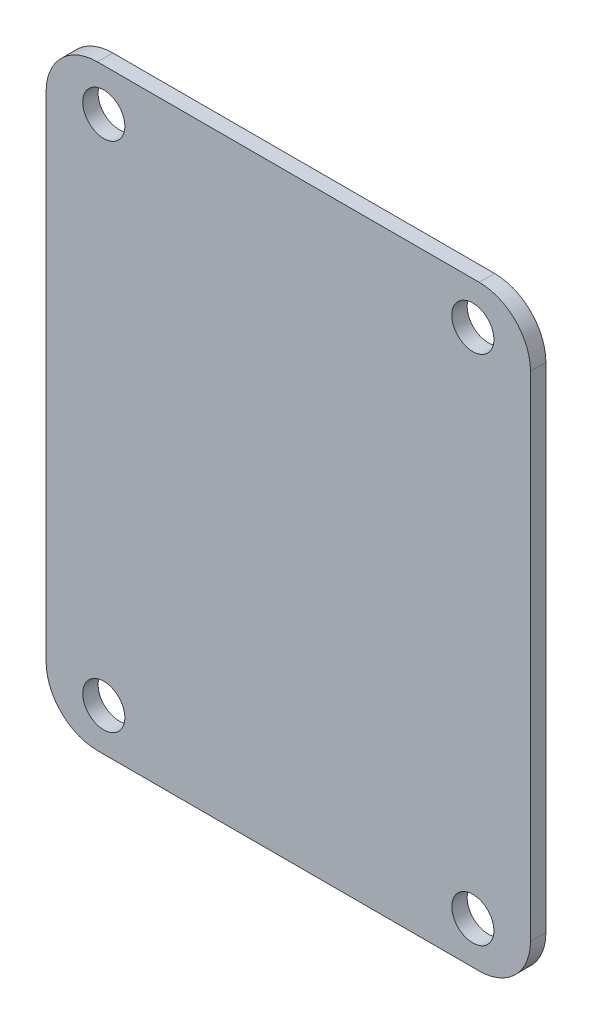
from build123d import *

# Parameters (mm, degrees)
SKETCH1_R           = 1.04267733
BOSS_EXTRUDE1_DEPTH = 0.762


with BuildPart() as part:
    # Sketch1 → Boss-Extrude1 (new body)
    with BuildSketch(Plane.XY):
        with BuildLine():
            Line((12.100363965, 4.486555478), (12.100363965, -19.973555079))
            ThreePointArc((12.100363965, -19.973555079), (11.35641519, -21.769606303), (9.560363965, -22.513555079))
            Line((9.560363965, -22.513555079), (-9.348625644, -22.513555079))
            ThreePointArc((-9.348625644, -22.513555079), (-11.144676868, -21.769606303), (-11.888625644, -19.973555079))
            Line((-11.888625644, -19.973555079), (-11.888625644, 4.486555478))
            ThreePointArc((-11.888625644, 4.486555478), (-11.144676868, 6.282606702), (-9.348625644, 7.026555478))
            Line((-9.348625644, 7.026555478), (9.560363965, 7.026555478))
            ThreePointArc((9.560363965, 7.026555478), (11.35641519, 6.282606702), (12.100363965, 4.486555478))
        make_face()
        with Locations(Location((-9.032869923, 4.937406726, 0), (0, 0, 180))):
            Circle(SKETCH1_R, mode=Mode.SUBTRACT)
        with Locations(Location((9.244608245, 4.937406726, 0), (0, 0, 180))):
            Circle(SKETCH1_R, mode=Mode.SUBTRACT)
        with Locations(Location((9.244608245, -20.424406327, 0), (0, 0, 180))):
            Circle(SKETCH1_R, mode=Mode.SUBTRACT)
        with Locations(Location((-9.032869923, -20.424406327, 0), (0, 0, 180))):
            Circle(SKETCH1_R, mode=Mode.SUBTRACT)
    extrude(amount=BOSS_EXTRUDE1_DEPTH)


solid = part.part
